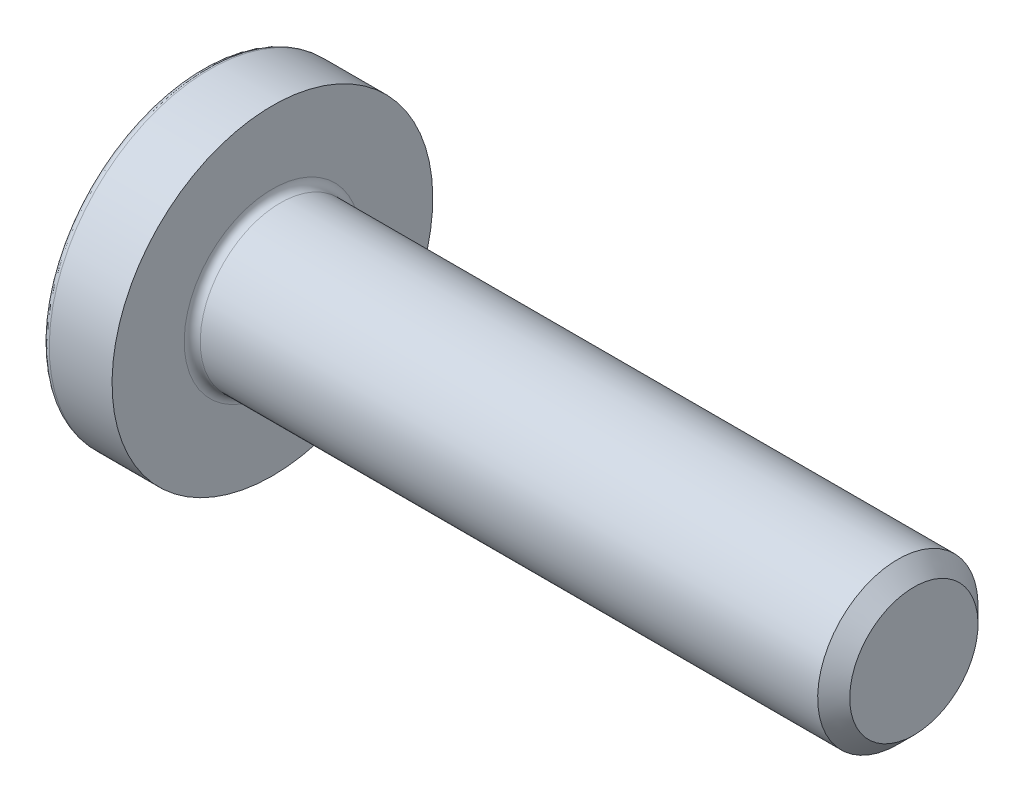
from build123d import *

# Parameters (mm, degrees)
R_P_TITION_CIRCULAIRE1_COUNT = 2
R_P_TITION_CIRCULAIRE1_ANGLE = 90
ESQUISSE4_R                  = 1.5
ENL_V_MAT_EXTRU_2_DEPTH      = 3.5
ENL_V_MAT_EXTRU_2_DRAFT      = -4


with BuildPart() as part:
    # Esquisse1 → R_volution1 (revolve)
    with BuildSketch(Plane.XY, mode=Mode.PRIVATE) as r_volution1_sk:
        with BuildLine():
            Line((-2.348566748, 6), (0, 6))
            Line((0, 6), (0, 3.3))
            ThreePointArc((0, 3.3), (0.087867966, 3.087867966), (0.3, 3))
            Line((0.3, 3), (23.4, 3))
            Line((23.4, 3), (24, 2.4))
            Line((24, 2.4), (24, 0))
            Line((24, 0), (-4.5, 0))
            ThreePointArc((-4.5, 0), (-4.010863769, 3.089250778), (-2.591305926, 5.87628866))
            ThreePointArc((-2.591305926, 5.87628866), (-2.484789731, 5.967288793), (-2.348566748, 6))
        make_face()
    revolve(r_volution1_sk.sketch.rotate(Axis((-13.190662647, 0, 0), (1, 0, 0)), 180), axis=Axis((-13.190662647, 0, 0), (1, 0, 0)))

    # Esquisse3 → Enl_vement de mati_re-Lissage1 section 0
    with BuildSketch(Plane.ZY.offset(1)):
        with BuildLine():
            Line((-0.75, -1.5), (0.75, -1.5))
            Line((0.75, -1.5), (0.75, 1.5))
            Line((0.75, 1.5), (-0.75, 1.5))
            Line((-0.75, 1.5), (-0.75, -1.5))
        make_face()
    # Esquisse2 → Enl_vement de mati_re-Lissage1 section 1
    with BuildSketch(Plane.ZY.offset(4.5)):
        with BuildLine():
            Line((-0.75, -3.1), (0.75, -3.1))
            Line((0.75, -3.1), (0.75, 3.1))
            Line((0.75, 3.1), (-0.75, 3.1))
            Line((-0.75, 3.1), (-0.75, -3.1))
        make_face()
    enl_vement_de_mati_re_lissage1 = loft(mode=Mode.SUBTRACT)

    # R_p_tition circulaire1: Enl_vement de mati_re-Lissage1 ×2 about axis
    r_p_tition_circulaire1_axis = Axis((0, 0, 0), (-1, 0, 0))
    for i in range(1, R_P_TITION_CIRCULAIRE1_COUNT):
        add(enl_vement_de_mati_re_lissage1.rotate(r_p_tition_circulaire1_axis, i * R_P_TITION_CIRCULAIRE1_ANGLE / (R_P_TITION_CIRCULAIRE1_COUNT - 1)), mode=Mode.SUBTRACT)


with BuildPart() as enl_v_mat_extru_2_tool:
    # Esquisse4 → Enl_v. mat.-Extru.2 (with draft: the straight prism first)
    with BuildSketch(Plane.ZY.offset(4.5)):
        Circle(ESQUISSE4_R)
    extrude(amount=-ENL_V_MAT_EXTRU_2_DEPTH)
    # Enl_v. mat.-Extru.2: the draft: its side faces are tilted about the plane it starts from
    enl_v_mat_extru_2_sides = [enl_v_mat_extru_2_tool.faces().sort_by_distance(p)[0] for p in [
        (-2.75, 0, -1.5),
    ]]
    draft(enl_v_mat_extru_2_sides, Plane.ZY.offset(4.5), ENL_V_MAT_EXTRU_2_DRAFT)


with BuildPart() as part_1:
    add(part.part)

    # Enl_v. mat.-Extru.2: cut by enl_v_mat_extru_2_tool
    add(enl_v_mat_extru_2_tool.part, mode=Mode.SUBTRACT)


solid = part_1.part
